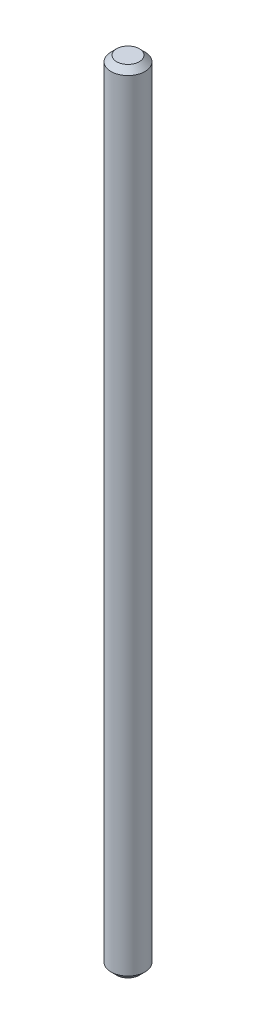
from build123d import *


with BuildPart() as part:
    # Esquisse1 → R_volution1 (revolve)
    with BuildSketch(Plane.XY):
        Polygon((0, 0), (-1, 0), (-1.5, 0.5), (-1.5, 69.5), (-1, 70), (0, 70), align=None)
    revolve(axis=Axis((0, 70, 0), (0, -1, 0)))


solid = part.part
